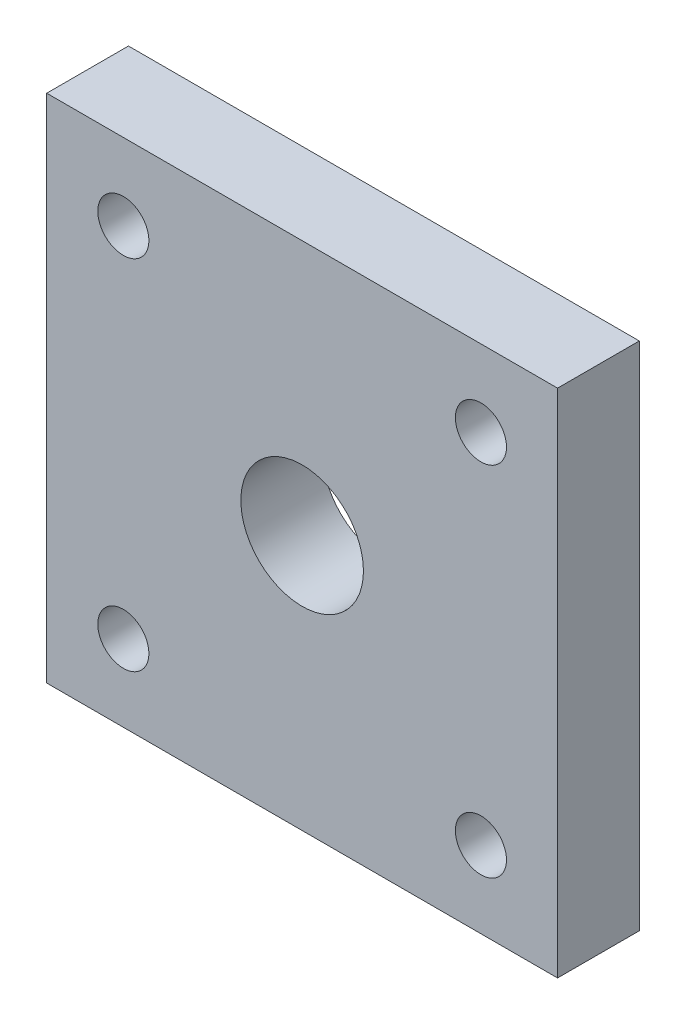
from build123d import *

# Parameters (mm, degrees)
SKETCH1_W           = 50
SKETCH1_H           = 50
BOSS_EXTRUDE1_DEPTH = 8
SKETCH2_R           = 6
CUT_EXTRUDE1_DEPTH  = 8
M6_TAPPED_HOLE1_D   = 5


with BuildPart() as part:
    # Sketch1 → Boss-Extrude1 (new body)
    with BuildSketch(Plane.XY):
        Rectangle(SKETCH1_W, SKETCH1_H)
    extrude(amount=BOSS_EXTRUDE1_DEPTH)

    # Sketch2 → Cut-Extrude1 (cut)
    with BuildSketch(Plane.XY.offset(8)):
        Circle(SKETCH2_R)
    extrude(amount=-CUT_EXTRUDE1_DEPTH, mode=Mode.SUBTRACT)

    # M6 Tapped Hole1 (through all)
    with Locations(Plane.XY.offset(8)):
        with Locations((17.5, 17.5), (17.5, -17.5), (-17.5, -17.5), (-17.5, 17.5)):
            Hole(M6_TAPPED_HOLE1_D / 2)


solid = part.part
